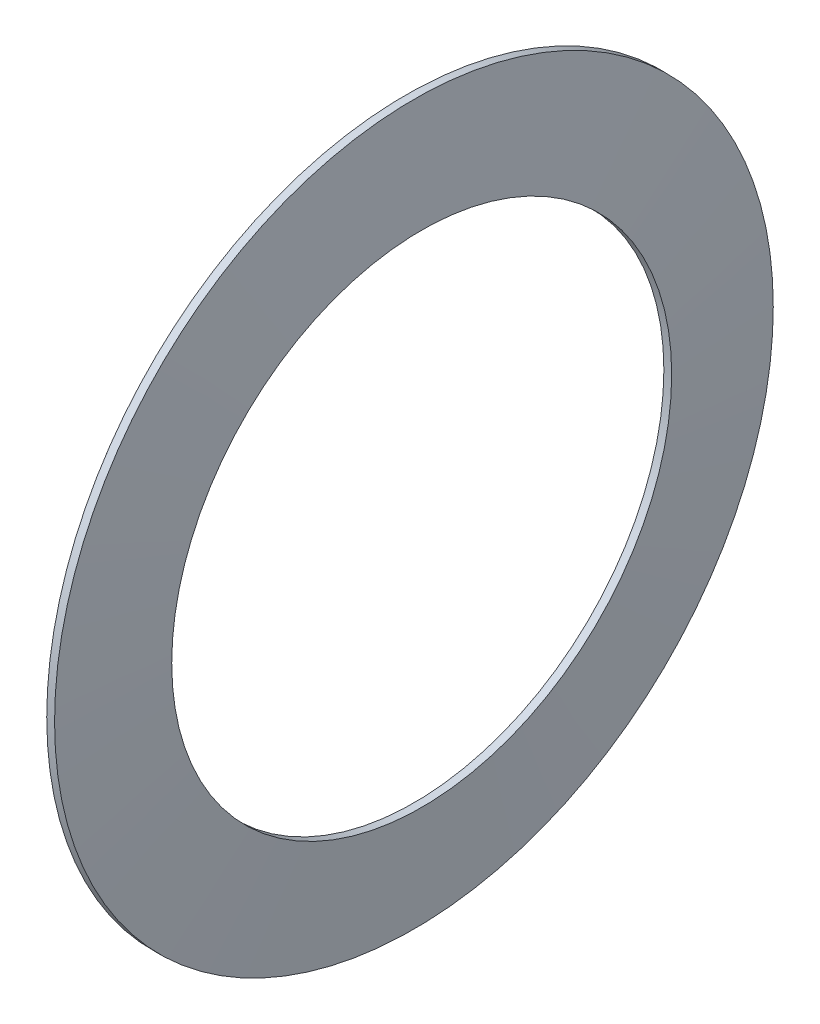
ISO-10303-21;
HEADER;
FILE_DESCRIPTION(('STEP AP214'),'2;1');
FILE_NAME('part.step','',(''),(''),'','','');
FILE_SCHEMA(('AUTOMOTIVE_DESIGN { 1 0 10303 214 1 1 1 1 }'));
ENDSEC;
DATA;
#1=APPLICATION_CONTEXT('core data for automotive mechanical design processes');
#2=APPLICATION_PROTOCOL_DEFINITION('international standard','automotive_design',2000,#1);
#3=PRODUCT_CONTEXT('',#1,'mechanical');
#4=PRODUCT('Part','Part','',(#3));
#5=PRODUCT_RELATED_PRODUCT_CATEGORY('part','',(#4));
#6=PRODUCT_DEFINITION_FORMATION('','',#4);
#7=PRODUCT_DEFINITION_CONTEXT('part definition',#1,'design');
#8=PRODUCT_DEFINITION('design','',#6,#7);
#9=PRODUCT_DEFINITION_SHAPE('','',#8);
#10=(LENGTH_UNIT() NAMED_UNIT(*) SI_UNIT(.MILLI.,.METRE.));
#11=(NAMED_UNIT(*) PLANE_ANGLE_UNIT() SI_UNIT($,.RADIAN.));
#12=(NAMED_UNIT(*) SI_UNIT($,.STERADIAN.) SOLID_ANGLE_UNIT());
#13=UNCERTAINTY_MEASURE_WITH_UNIT(LENGTH_MEASURE(1.E-05),#10,'distance_accuracy_value','');
#14=(GEOMETRIC_REPRESENTATION_CONTEXT(3) GLOBAL_UNCERTAINTY_ASSIGNED_CONTEXT((#13)) GLOBAL_UNIT_ASSIGNED_CONTEXT((#10,
#11,#12)) REPRESENTATION_CONTEXT('',''));
#15=CARTESIAN_POINT('',(0.,0.,0.));
#16=DIRECTION('',(0.,0.,1.));
#17=DIRECTION('',(1.,0.,0.));
#18=AXIS2_PLACEMENT_3D('',#15,#16,#17);
#19=CARTESIAN_POINT('',(0.,0.,0.));
#20=DIRECTION('',(-1.,0.,0.));
#21=DIRECTION('',(0.,0.,1.));
#22=AXIS2_PLACEMENT_3D('',#19,#20,#21);
#23=CONICAL_SURFACE('',#22,23.,1.49966900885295);
#24=CARTESIAN_POINT('',(0.498732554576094,0.,0.));
#25=DIRECTION('',(-1.,0.,0.));
#26=DIRECTION('',(0.,0.,1.));
#27=AXIS2_PLACEMENT_3D('',#24,#25,#26);
#28=CIRCLE('',#27,16.);
#29=CARTESIAN_POINT('',(0.498732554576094,0.,16.));
#30=VERTEX_POINT('',#29);
#31=EDGE_CURVE('E48',#30,#30,#28,.T.);
#32=ORIENTED_EDGE('',*,*,#31,.F.);
#33=EDGE_LOOP('',(#32));
#34=FACE_BOUND('',#33,.T.);
#35=CARTESIAN_POINT('',(0.,0.,0.));
#36=DIRECTION('',(-1.,0.,0.));
#37=DIRECTION('',(0.,0.,1.));
#38=AXIS2_PLACEMENT_3D('',#35,#36,#37);
#39=CIRCLE('',#38,23.);
#40=CARTESIAN_POINT('',(0.,0.,23.));
#41=VERTEX_POINT('',#40);
#42=EDGE_CURVE('E10',#41,#41,#39,.T.);
#43=ORIENTED_EDGE('',*,*,#42,.T.);
#44=EDGE_LOOP('',(#43));
#45=FACE_BOUND('',#44,.T.);
#46=ADVANCED_FACE('F34',(#34,#45),#23,.F.);
#47=CARTESIAN_POINT('',(0.,0.,0.));
#48=DIRECTION('',(-1.,0.,0.));
#49=DIRECTION('',(0.,0.,1.));
#50=AXIS2_PLACEMENT_3D('',#47,#48,#49);
#51=CYLINDRICAL_SURFACE('',#50,23.);
#52=ORIENTED_EDGE('',*,*,#42,.F.);
#53=EDGE_LOOP('',(#52));
#54=FACE_BOUND('',#53,.T.);
#55=CARTESIAN_POINT('',(0.501267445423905,0.,0.));
#56=DIRECTION('',(-1.,0.,0.));
#57=DIRECTION('',(0.,0.,1.));
#58=AXIS2_PLACEMENT_3D('',#55,#56,#57);
#59=CIRCLE('',#58,23.);
#60=CARTESIAN_POINT('',(0.501267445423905,0.,23.));
#61=VERTEX_POINT('',#60);
#62=EDGE_CURVE('E40',#61,#61,#59,.T.);
#63=ORIENTED_EDGE('',*,*,#62,.T.);
#64=EDGE_LOOP('',(#63));
#65=FACE_BOUND('',#64,.T.);
#66=ADVANCED_FACE('F57',(#54,#65),#51,.T.);
#67=CARTESIAN_POINT('',(0.999999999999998,0.,0.));
#68=DIRECTION('',(-1.,0.,0.));
#69=DIRECTION('',(0.,0.,1.));
#70=AXIS2_PLACEMENT_3D('',#67,#68,#69);
#71=CONICAL_SURFACE('',#70,16.,1.49966900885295);
#72=ORIENTED_EDGE('',*,*,#62,.F.);
#73=EDGE_LOOP('',(#72));
#74=FACE_BOUND('',#73,.T.);
#75=CARTESIAN_POINT('',(0.999999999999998,0.,0.));
#76=DIRECTION('',(-1.,0.,0.));
#77=DIRECTION('',(0.,0.,1.));
#78=AXIS2_PLACEMENT_3D('',#75,#76,#77);
#79=CIRCLE('',#78,16.);
#80=CARTESIAN_POINT('',(0.999999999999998,0.,16.));
#81=VERTEX_POINT('',#80);
#82=EDGE_CURVE('E44',#81,#81,#79,.T.);
#83=ORIENTED_EDGE('',*,*,#82,.T.);
#84=EDGE_LOOP('',(#83));
#85=FACE_BOUND('',#84,.T.);
#86=ADVANCED_FACE('F61',(#74,#85),#71,.T.);
#87=CARTESIAN_POINT('',(0.,0.,0.));
#88=DIRECTION('',(-1.,0.,0.));
#89=DIRECTION('',(0.,0.,1.));
#90=AXIS2_PLACEMENT_3D('',#87,#88,#89);
#91=CYLINDRICAL_SURFACE('',#90,16.);
#92=ORIENTED_EDGE('',*,*,#82,.F.);
#93=EDGE_LOOP('',(#92));
#94=FACE_BOUND('',#93,.T.);
#95=ORIENTED_EDGE('',*,*,#31,.T.);
#96=EDGE_LOOP('',(#95));
#97=FACE_BOUND('',#96,.T.);
#98=ADVANCED_FACE('F54',(#94,#97),#91,.F.);
#99=CLOSED_SHELL('',(#46,#66,#86,#98));
#100=MANIFOLD_SOLID_BREP('B2',#99);
#101=ADVANCED_BREP_SHAPE_REPRESENTATION('',(#18,#100),#14);
#102=SHAPE_DEFINITION_REPRESENTATION(#9,#101);
ENDSEC;
END-ISO-10303-21;
